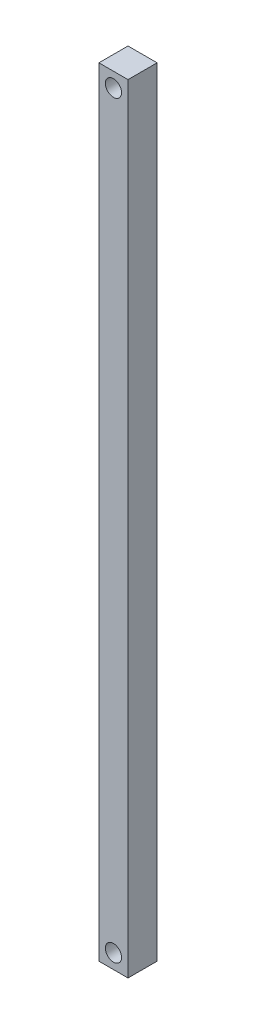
ISO-10303-21;
HEADER;
FILE_DESCRIPTION(('STEP AP214'),'2;1');
FILE_NAME('part.step','',(''),(''),'','','');
FILE_SCHEMA(('AUTOMOTIVE_DESIGN { 1 0 10303 214 1 1 1 1 }'));
ENDSEC;
DATA;
#1=APPLICATION_CONTEXT('core data for automotive mechanical design processes');
#2=APPLICATION_PROTOCOL_DEFINITION('international standard','automotive_design',2000,#1);
#3=PRODUCT_CONTEXT('',#1,'mechanical');
#4=PRODUCT('Part','Part','',(#3));
#5=PRODUCT_RELATED_PRODUCT_CATEGORY('part','',(#4));
#6=PRODUCT_DEFINITION_FORMATION('','',#4);
#7=PRODUCT_DEFINITION_CONTEXT('part definition',#1,'design');
#8=PRODUCT_DEFINITION('design','',#6,#7);
#9=PRODUCT_DEFINITION_SHAPE('','',#8);
#10=(LENGTH_UNIT() NAMED_UNIT(*) SI_UNIT(.MILLI.,.METRE.));
#11=(NAMED_UNIT(*) PLANE_ANGLE_UNIT() SI_UNIT($,.RADIAN.));
#12=(NAMED_UNIT(*) SI_UNIT($,.STERADIAN.) SOLID_ANGLE_UNIT());
#13=UNCERTAINTY_MEASURE_WITH_UNIT(LENGTH_MEASURE(1.E-05),#10,'distance_accuracy_value','');
#14=(GEOMETRIC_REPRESENTATION_CONTEXT(3) GLOBAL_UNCERTAINTY_ASSIGNED_CONTEXT((#13)) GLOBAL_UNIT_ASSIGNED_CONTEXT((#10,
#11,#12)) REPRESENTATION_CONTEXT('',''));
#15=CARTESIAN_POINT('',(0.,0.,0.));
#16=DIRECTION('',(0.,0.,1.));
#17=DIRECTION('',(1.,0.,0.));
#18=AXIS2_PLACEMENT_3D('',#15,#16,#17);
#19=CARTESIAN_POINT('',(0.,0.,18.7));
#20=DIRECTION('',(0.,0.,-1.));
#21=DIRECTION('',(-1.,0.,0.));
#22=AXIS2_PLACEMENT_3D('',#19,#20,#21);
#23=PLANE('',#22);
#24=DIRECTION('',(0.,-1.,0.));
#25=VECTOR('',#24,1.);
#26=CARTESIAN_POINT('',(-3.76965671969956,0.,18.7));
#27=LINE('',#26,#25);
#28=CARTESIAN_POINT('',(-3.76965671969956,500.,18.7));
#29=VERTEX_POINT('',#28);
#30=CARTESIAN_POINT('',(-3.76965671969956,0.,18.7));
#31=VERTEX_POINT('',#30);
#32=EDGE_CURVE('E98',#29,#31,#27,.T.);
#33=ORIENTED_EDGE('',*,*,#32,.T.);
#34=DIRECTION('',(1.,0.,0.));
#35=VECTOR('',#34,1.);
#36=CARTESIAN_POINT('',(-3.76965671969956,0.,18.7));
#37=LINE('',#36,#35);
#38=CARTESIAN_POINT('',(14.9303432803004,0.,18.7));
#39=VERTEX_POINT('',#38);
#40=EDGE_CURVE('E93',#31,#39,#37,.T.);
#41=ORIENTED_EDGE('',*,*,#40,.T.);
#42=DIRECTION('',(0.,1.,0.));
#43=VECTOR('',#42,1.);
#44=CARTESIAN_POINT('',(14.9303432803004,0.,18.7));
#45=LINE('',#44,#43);
#46=CARTESIAN_POINT('',(14.9303432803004,500.,18.7));
#47=VERTEX_POINT('',#46);
#48=EDGE_CURVE('E96',#39,#47,#45,.T.);
#49=ORIENTED_EDGE('',*,*,#48,.T.);
#50=DIRECTION('',(-1.,0.,0.));
#51=VECTOR('',#50,1.);
#52=CARTESIAN_POINT('',(-3.76965671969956,500.,18.7));
#53=LINE('',#52,#51);
#54=EDGE_CURVE('E63',#47,#29,#53,.T.);
#55=ORIENTED_EDGE('',*,*,#54,.T.);
#56=EDGE_LOOP('',(#33,#41,#49,#55));
#57=FACE_BOUND('',#56,.T.);
#58=CARTESIAN_POINT('',(5.58034328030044,490.65,18.7));
#59=DIRECTION('',(0.,0.,1.));
#60=DIRECTION('',(1.,0.,0.));
#61=AXIS2_PLACEMENT_3D('',#58,#59,#60);
#62=CIRCLE('',#61,5.19999999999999);
#63=CARTESIAN_POINT('',(10.7803432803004,490.65,18.7));
#64=VERTEX_POINT('',#63);
#65=EDGE_CURVE('E118',#64,#64,#62,.T.);
#66=ORIENTED_EDGE('',*,*,#65,.F.);
#67=EDGE_LOOP('',(#66));
#68=FACE_BOUND('',#67,.T.);
#69=CARTESIAN_POINT('',(5.58034328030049,9.35,18.7));
#70=DIRECTION('',(0.,0.,1.));
#71=DIRECTION('',(1.,0.,0.));
#72=AXIS2_PLACEMENT_3D('',#69,#70,#71);
#73=CIRCLE('',#72,5.2);
#74=CARTESIAN_POINT('',(10.7803432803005,9.35,18.7));
#75=VERTEX_POINT('',#74);
#76=EDGE_CURVE('E140',#75,#75,#73,.T.);
#77=ORIENTED_EDGE('',*,*,#76,.F.);
#78=EDGE_LOOP('',(#77));
#79=FACE_BOUND('',#78,.T.);
#80=ADVANCED_FACE('F45',(#57,#68,#79),#23,.F.);
#81=CARTESIAN_POINT('',(0.,0.,0.));
#82=DIRECTION('',(0.,0.,-1.));
#83=DIRECTION('',(-1.,0.,0.));
#84=AXIS2_PLACEMENT_3D('',#81,#82,#83);
#85=PLANE('',#84);
#86=CARTESIAN_POINT('',(5.58034328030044,490.65,0.));
#87=DIRECTION('',(0.,0.,1.));
#88=DIRECTION('',(1.,0.,0.));
#89=AXIS2_PLACEMENT_3D('',#86,#87,#88);
#90=CIRCLE('',#89,5.19999999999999);
#91=CARTESIAN_POINT('',(10.7803432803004,490.65,0.));
#92=VERTEX_POINT('',#91);
#93=EDGE_CURVE('E136',#92,#92,#90,.T.);
#94=ORIENTED_EDGE('',*,*,#93,.T.);
#95=EDGE_LOOP('',(#94));
#96=FACE_BOUND('',#95,.T.);
#97=DIRECTION('',(0.,-1.,0.));
#98=VECTOR('',#97,1.);
#99=CARTESIAN_POINT('',(-3.76965671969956,0.,0.));
#100=LINE('',#99,#98);
#101=CARTESIAN_POINT('',(-3.76965671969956,500.,0.));
#102=VERTEX_POINT('',#101);
#103=CARTESIAN_POINT('',(-3.76965671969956,0.,0.));
#104=VERTEX_POINT('',#103);
#105=EDGE_CURVE('E114',#102,#104,#100,.T.);
#106=ORIENTED_EDGE('',*,*,#105,.F.);
#107=DIRECTION('',(-1.,0.,0.));
#108=VECTOR('',#107,1.);
#109=CARTESIAN_POINT('',(-3.76965671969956,500.,0.));
#110=LINE('',#109,#108);
#111=CARTESIAN_POINT('',(14.9303432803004,500.,0.));
#112=VERTEX_POINT('',#111);
#113=EDGE_CURVE('E86',#112,#102,#110,.T.);
#114=ORIENTED_EDGE('',*,*,#113,.F.);
#115=DIRECTION('',(0.,1.,0.));
#116=VECTOR('',#115,1.);
#117=CARTESIAN_POINT('',(14.9303432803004,0.,0.));
#118=LINE('',#117,#116);
#119=CARTESIAN_POINT('',(14.9303432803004,0.,0.));
#120=VERTEX_POINT('',#119);
#121=EDGE_CURVE('E80',#120,#112,#118,.T.);
#122=ORIENTED_EDGE('',*,*,#121,.F.);
#123=DIRECTION('',(1.,0.,0.));
#124=VECTOR('',#123,1.);
#125=CARTESIAN_POINT('',(-3.76965671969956,0.,0.));
#126=LINE('',#125,#124);
#127=EDGE_CURVE('E103',#104,#120,#126,.T.);
#128=ORIENTED_EDGE('',*,*,#127,.F.);
#129=EDGE_LOOP('',(#106,#114,#122,#128));
#130=FACE_BOUND('',#129,.T.);
#131=CARTESIAN_POINT('',(5.58034328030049,9.35,0.));
#132=DIRECTION('',(0.,0.,1.));
#133=DIRECTION('',(1.,0.,0.));
#134=AXIS2_PLACEMENT_3D('',#131,#132,#133);
#135=CIRCLE('',#134,5.2);
#136=CARTESIAN_POINT('',(10.7803432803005,9.35,0.));
#137=VERTEX_POINT('',#136);
#138=EDGE_CURVE('E144',#137,#137,#135,.T.);
#139=ORIENTED_EDGE('',*,*,#138,.T.);
#140=EDGE_LOOP('',(#139));
#141=FACE_BOUND('',#140,.T.);
#142=ADVANCED_FACE('F131',(#96,#130,#141),#85,.T.);
#143=CARTESIAN_POINT('',(-3.76965671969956,0.,18.7));
#144=DIRECTION('',(1.,0.,0.));
#145=DIRECTION('',(0.,0.,-1.));
#146=AXIS2_PLACEMENT_3D('',#143,#144,#145);
#147=PLANE('',#146);
#148=ORIENTED_EDGE('',*,*,#105,.T.);
#149=DIRECTION('',(0.,0.,-1.));
#150=VECTOR('',#149,1.);
#151=CARTESIAN_POINT('',(-3.76965671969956,0.,18.7));
#152=LINE('',#151,#150);
#153=EDGE_CURVE('E11',#31,#104,#152,.T.);
#154=ORIENTED_EDGE('',*,*,#153,.F.);
#155=ORIENTED_EDGE('',*,*,#32,.F.);
#156=DIRECTION('',(0.,0.,-1.));
#157=VECTOR('',#156,1.);
#158=CARTESIAN_POINT('',(-3.76965671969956,500.,18.7));
#159=LINE('',#158,#157);
#160=EDGE_CURVE('E110',#29,#102,#159,.T.);
#161=ORIENTED_EDGE('',*,*,#160,.T.);
#162=EDGE_LOOP('',(#148,#154,#155,#161));
#163=FACE_BOUND('',#162,.T.);
#164=ADVANCED_FACE('F47',(#163),#147,.F.);
#165=CARTESIAN_POINT('',(-3.76965671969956,0.,18.7));
#166=DIRECTION('',(0.,1.,0.));
#167=DIRECTION('',(0.,0.,1.));
#168=AXIS2_PLACEMENT_3D('',#165,#166,#167);
#169=PLANE('',#168);
#170=ORIENTED_EDGE('',*,*,#127,.T.);
#171=DIRECTION('',(0.,0.,-1.));
#172=VECTOR('',#171,1.);
#173=CARTESIAN_POINT('',(14.9303432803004,0.,18.7));
#174=LINE('',#173,#172);
#175=EDGE_CURVE('E55',#39,#120,#174,.T.);
#176=ORIENTED_EDGE('',*,*,#175,.F.);
#177=ORIENTED_EDGE('',*,*,#40,.F.);
#178=ORIENTED_EDGE('',*,*,#153,.T.);
#179=EDGE_LOOP('',(#170,#176,#177,#178));
#180=FACE_BOUND('',#179,.T.);
#181=ADVANCED_FACE('F102',(#180),#169,.F.);
#182=CARTESIAN_POINT('',(14.9303432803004,0.,18.7));
#183=DIRECTION('',(-1.,0.,0.));
#184=DIRECTION('',(0.,0.,1.));
#185=AXIS2_PLACEMENT_3D('',#182,#183,#184);
#186=PLANE('',#185);
#187=ORIENTED_EDGE('',*,*,#121,.T.);
#188=DIRECTION('',(0.,0.,-1.));
#189=VECTOR('',#188,1.);
#190=CARTESIAN_POINT('',(14.9303432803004,500.,18.7));
#191=LINE('',#190,#189);
#192=EDGE_CURVE('E105',#47,#112,#191,.T.);
#193=ORIENTED_EDGE('',*,*,#192,.F.);
#194=ORIENTED_EDGE('',*,*,#48,.F.);
#195=ORIENTED_EDGE('',*,*,#175,.T.);
#196=EDGE_LOOP('',(#187,#193,#194,#195));
#197=FACE_BOUND('',#196,.T.);
#198=ADVANCED_FACE('F106',(#197),#186,.F.);
#199=CARTESIAN_POINT('',(-3.76965671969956,500.,18.7));
#200=DIRECTION('',(0.,-1.,0.));
#201=DIRECTION('',(0.,0.,-1.));
#202=AXIS2_PLACEMENT_3D('',#199,#200,#201);
#203=PLANE('',#202);
#204=ORIENTED_EDGE('',*,*,#113,.T.);
#205=ORIENTED_EDGE('',*,*,#160,.F.);
#206=ORIENTED_EDGE('',*,*,#54,.F.);
#207=ORIENTED_EDGE('',*,*,#192,.T.);
#208=EDGE_LOOP('',(#204,#205,#206,#207));
#209=FACE_BOUND('',#208,.T.);
#210=ADVANCED_FACE('F128',(#209),#203,.F.);
#211=CARTESIAN_POINT('',(5.58034328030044,490.65,18.7));
#212=DIRECTION('',(0.,0.,-1.));
#213=DIRECTION('',(-1.,0.,0.));
#214=AXIS2_PLACEMENT_3D('',#211,#212,#213);
#215=CYLINDRICAL_SURFACE('',#214,5.19999999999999);
#216=ORIENTED_EDGE('',*,*,#65,.T.);
#217=EDGE_LOOP('',(#216));
#218=FACE_BOUND('',#217,.T.);
#219=ORIENTED_EDGE('',*,*,#93,.F.);
#220=EDGE_LOOP('',(#219));
#221=FACE_BOUND('',#220,.T.);
#222=ADVANCED_FACE('F163',(#218,#221),#215,.F.);
#223=CARTESIAN_POINT('',(5.58034328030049,9.35,18.7));
#224=DIRECTION('',(0.,0.,-1.));
#225=DIRECTION('',(-1.,0.,0.));
#226=AXIS2_PLACEMENT_3D('',#223,#224,#225);
#227=CYLINDRICAL_SURFACE('',#226,5.2);
#228=ORIENTED_EDGE('',*,*,#76,.T.);
#229=EDGE_LOOP('',(#228));
#230=FACE_BOUND('',#229,.T.);
#231=ORIENTED_EDGE('',*,*,#138,.F.);
#232=EDGE_LOOP('',(#231));
#233=FACE_BOUND('',#232,.T.);
#234=ADVANCED_FACE('F152',(#230,#233),#227,.F.);
#235=CLOSED_SHELL('',(#80,#142,#164,#181,#198,#210,#222,#234));
#236=MANIFOLD_SOLID_BREP('B2',#235);
#237=ADVANCED_BREP_SHAPE_REPRESENTATION('',(#18,#236),#14);
#238=SHAPE_DEFINITION_REPRESENTATION(#9,#237);
ENDSEC;
END-ISO-10303-21;
